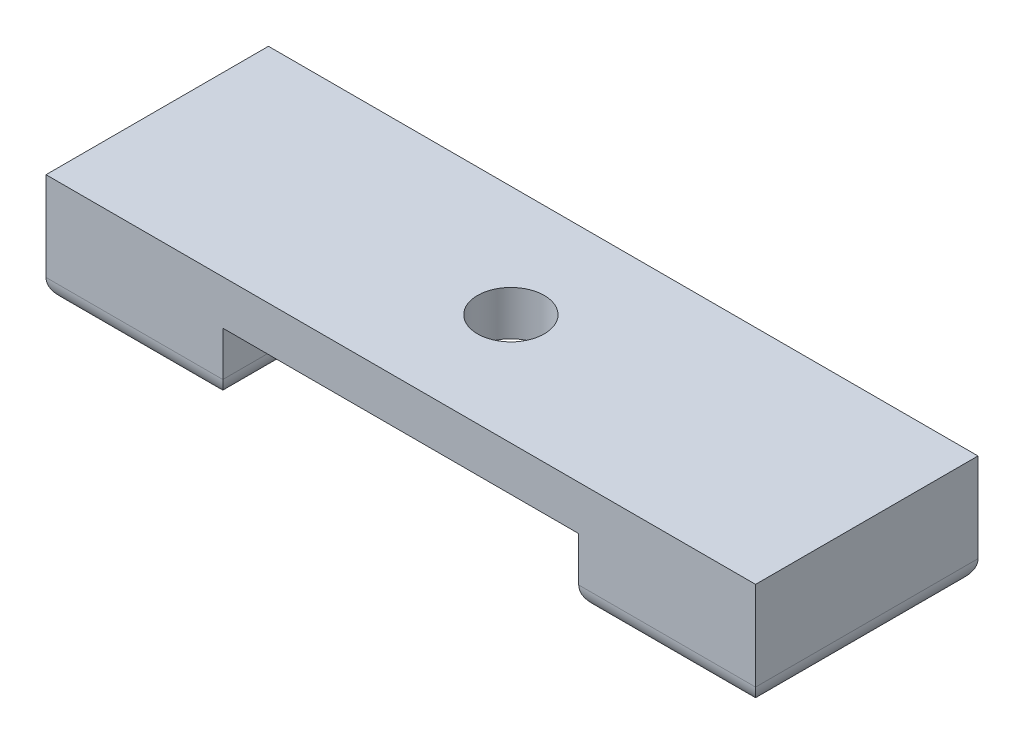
ISO-10303-21;
HEADER;
FILE_DESCRIPTION(('STEP AP214'),'2;1');
FILE_NAME('part.step','',(''),(''),'','','');
FILE_SCHEMA(('AUTOMOTIVE_DESIGN { 1 0 10303 214 1 1 1 1 }'));
ENDSEC;
DATA;
#1=APPLICATION_CONTEXT('core data for automotive mechanical design processes');
#2=APPLICATION_PROTOCOL_DEFINITION('international standard','automotive_design',2000,#1);
#3=PRODUCT_CONTEXT('',#1,'mechanical');
#4=PRODUCT('Part','Part','',(#3));
#5=PRODUCT_RELATED_PRODUCT_CATEGORY('part','',(#4));
#6=PRODUCT_DEFINITION_FORMATION('','',#4);
#7=PRODUCT_DEFINITION_CONTEXT('part definition',#1,'design');
#8=PRODUCT_DEFINITION('design','',#6,#7);
#9=PRODUCT_DEFINITION_SHAPE('','',#8);
#10=(LENGTH_UNIT() NAMED_UNIT(*) SI_UNIT(.MILLI.,.METRE.));
#11=(NAMED_UNIT(*) PLANE_ANGLE_UNIT() SI_UNIT($,.RADIAN.));
#12=(NAMED_UNIT(*) SI_UNIT($,.STERADIAN.) SOLID_ANGLE_UNIT());
#13=UNCERTAINTY_MEASURE_WITH_UNIT(LENGTH_MEASURE(1.E-05),#10,'distance_accuracy_value','');
#14=(GEOMETRIC_REPRESENTATION_CONTEXT(3) GLOBAL_UNCERTAINTY_ASSIGNED_CONTEXT((#13)) GLOBAL_UNIT_ASSIGNED_CONTEXT((#10,
#11,#12)) REPRESENTATION_CONTEXT('',''));
#15=CARTESIAN_POINT('',(0.,0.,0.));
#16=DIRECTION('',(0.,0.,1.));
#17=DIRECTION('',(1.,0.,0.));
#18=AXIS2_PLACEMENT_3D('',#15,#16,#17);
#19=CARTESIAN_POINT('',(0.,5.,10.));
#20=DIRECTION('',(1.,0.,0.));
#21=DIRECTION('',(0.,0.,-1.));
#22=AXIS2_PLACEMENT_3D('',#19,#20,#21);
#23=PLANE('',#22);
#24=DIRECTION('',(0.,-1.,0.));
#25=VECTOR('',#24,1.);
#26=CARTESIAN_POINT('',(0.,5.,0.));
#27=LINE('',#26,#25);
#28=CARTESIAN_POINT('',(0.,5.,0.));
#29=VERTEX_POINT('',#28);
#30=CARTESIAN_POINT('',(0.,1.,0.));
#31=VERTEX_POINT('',#30);
#32=EDGE_CURVE('E151',#29,#31,#27,.T.);
#33=ORIENTED_EDGE('',*,*,#32,.T.);
#34=DIRECTION('',(0.,0.,-1.));
#35=VECTOR('',#34,1.);
#36=CARTESIAN_POINT('',(0.,1.,10.));
#37=LINE('',#36,#35);
#38=CARTESIAN_POINT('',(0.,1.,10.));
#39=VERTEX_POINT('',#38);
#40=EDGE_CURVE('E208',#31,#39,#37,.F.);
#41=ORIENTED_EDGE('',*,*,#40,.T.);
#42=DIRECTION('',(0.,-1.,0.));
#43=VECTOR('',#42,1.);
#44=CARTESIAN_POINT('',(0.,5.,10.));
#45=LINE('',#44,#43);
#46=CARTESIAN_POINT('',(0.,5.,10.));
#47=VERTEX_POINT('',#46);
#48=EDGE_CURVE('E127',#47,#39,#45,.T.);
#49=ORIENTED_EDGE('',*,*,#48,.F.);
#50=DIRECTION('',(0.,0.,-1.));
#51=VECTOR('',#50,1.);
#52=CARTESIAN_POINT('',(0.,5.,10.));
#53=LINE('',#52,#51);
#54=EDGE_CURVE('E150',#47,#29,#53,.T.);
#55=ORIENTED_EDGE('',*,*,#54,.T.);
#56=EDGE_LOOP('',(#33,#41,#49,#55));
#57=FACE_BOUND('',#56,.T.);
#58=ADVANCED_FACE('F33',(#57),#23,.F.);
#59=CARTESIAN_POINT('',(0.,0.,10.));
#60=DIRECTION('',(0.,1.,0.));
#61=DIRECTION('',(0.,0.,1.));
#62=AXIS2_PLACEMENT_3D('',#59,#60,#61);
#63=PLANE('',#62);
#64=DIRECTION('',(1.,0.,0.));
#65=VECTOR('',#64,1.);
#66=CARTESIAN_POINT('',(0.,0.,9.));
#67=LINE('',#66,#65);
#68=CARTESIAN_POINT('',(6.95,0.,9.));
#69=VERTEX_POINT('',#68);
#70=CARTESIAN_POINT('',(1.,0.,9.));
#71=VERTEX_POINT('',#70);
#72=EDGE_CURVE('E203',#69,#71,#67,.F.);
#73=ORIENTED_EDGE('',*,*,#72,.T.);
#74=DIRECTION('',(0.,0.,-1.));
#75=VECTOR('',#74,1.);
#76=CARTESIAN_POINT('',(1.,0.,10.));
#77=LINE('',#76,#75);
#78=CARTESIAN_POINT('',(1.,0.,0.999999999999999));
#79=VERTEX_POINT('',#78);
#80=EDGE_CURVE('E205',#71,#79,#77,.T.);
#81=ORIENTED_EDGE('',*,*,#80,.T.);
#82=DIRECTION('',(1.,0.,0.));
#83=VECTOR('',#82,1.);
#84=CARTESIAN_POINT('',(0.,0.,0.999999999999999));
#85=LINE('',#84,#83);
#86=CARTESIAN_POINT('',(6.95,0.,0.999999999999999));
#87=VERTEX_POINT('',#86);
#88=EDGE_CURVE('E188',#79,#87,#85,.T.);
#89=ORIENTED_EDGE('',*,*,#88,.T.);
#90=DIRECTION('',(0.,0.,-1.));
#91=VECTOR('',#90,1.);
#92=CARTESIAN_POINT('',(6.95,0.,10.));
#93=LINE('',#92,#91);
#94=EDGE_CURVE('E201',#87,#69,#93,.F.);
#95=ORIENTED_EDGE('',*,*,#94,.T.);
#96=EDGE_LOOP('',(#73,#81,#89,#95));
#97=FACE_BOUND('',#96,.T.);
#98=ADVANCED_FACE('F244',(#97),#63,.F.);
#99=CARTESIAN_POINT('',(7.95,0.,10.));
#100=DIRECTION('',(-1.,0.,0.));
#101=DIRECTION('',(0.,0.,1.));
#102=AXIS2_PLACEMENT_3D('',#99,#100,#101);
#103=PLANE('',#102);
#104=DIRECTION('',(0.,1.,0.));
#105=VECTOR('',#104,1.);
#106=CARTESIAN_POINT('',(7.95,0.,10.));
#107=LINE('',#106,#105);
#108=CARTESIAN_POINT('',(7.95,1.,10.));
#109=VERTEX_POINT('',#108);
#110=CARTESIAN_POINT('',(7.95,3.,10.));
#111=VERTEX_POINT('',#110);
#112=EDGE_CURVE('E120',#109,#111,#107,.T.);
#113=ORIENTED_EDGE('',*,*,#112,.F.);
#114=DIRECTION('',(0.,0.,-1.));
#115=VECTOR('',#114,1.);
#116=CARTESIAN_POINT('',(7.95,1.,10.));
#117=LINE('',#116,#115);
#118=CARTESIAN_POINT('',(7.95,1.,0.));
#119=VERTEX_POINT('',#118);
#120=EDGE_CURVE('E42',#109,#119,#117,.T.);
#121=ORIENTED_EDGE('',*,*,#120,.T.);
#122=DIRECTION('',(0.,1.,0.));
#123=VECTOR('',#122,1.);
#124=CARTESIAN_POINT('',(7.95,0.,0.));
#125=LINE('',#124,#123);
#126=CARTESIAN_POINT('',(7.95,3.,0.));
#127=VERTEX_POINT('',#126);
#128=EDGE_CURVE('E132',#119,#127,#125,.T.);
#129=ORIENTED_EDGE('',*,*,#128,.T.);
#130=DIRECTION('',(0.,0.,-1.));
#131=VECTOR('',#130,1.);
#132=CARTESIAN_POINT('',(7.95,3.,10.));
#133=LINE('',#132,#131);
#134=EDGE_CURVE('E130',#111,#127,#133,.T.);
#135=ORIENTED_EDGE('',*,*,#134,.F.);
#136=EDGE_LOOP('',(#113,#121,#129,#135));
#137=FACE_BOUND('',#136,.T.);
#138=ADVANCED_FACE('F131',(#137),#103,.F.);
#139=CARTESIAN_POINT('',(7.95,3.,10.));
#140=DIRECTION('',(0.,1.,0.));
#141=DIRECTION('',(0.,0.,1.));
#142=AXIS2_PLACEMENT_3D('',#139,#140,#141);
#143=PLANE('',#142);
#144=CARTESIAN_POINT('',(15.9,3.,5.));
#145=DIRECTION('',(0.,1.,0.));
#146=DIRECTION('',(0.,0.,1.));
#147=AXIS2_PLACEMENT_3D('',#144,#145,#146);
#148=CIRCLE('',#147,1.5);
#149=CARTESIAN_POINT('',(15.9,3.,6.5));
#150=VERTEX_POINT('',#149);
#151=EDGE_CURVE('E154',#150,#150,#148,.T.);
#152=ORIENTED_EDGE('',*,*,#151,.T.);
#153=EDGE_LOOP('',(#152));
#154=FACE_BOUND('',#153,.T.);
#155=DIRECTION('',(1.,0.,0.));
#156=VECTOR('',#155,1.);
#157=CARTESIAN_POINT('',(7.95,3.,0.));
#158=LINE('',#157,#156);
#159=CARTESIAN_POINT('',(23.95,3.,0.));
#160=VERTEX_POINT('',#159);
#161=EDGE_CURVE('E156',#127,#160,#158,.T.);
#162=ORIENTED_EDGE('',*,*,#161,.T.);
#163=DIRECTION('',(0.,0.,-1.));
#164=VECTOR('',#163,1.);
#165=CARTESIAN_POINT('',(23.95,3.,10.));
#166=LINE('',#165,#164);
#167=CARTESIAN_POINT('',(23.95,3.,10.));
#168=VERTEX_POINT('',#167);
#169=EDGE_CURVE('E136',#168,#160,#166,.T.);
#170=ORIENTED_EDGE('',*,*,#169,.F.);
#171=DIRECTION('',(1.,0.,0.));
#172=VECTOR('',#171,1.);
#173=CARTESIAN_POINT('',(7.95,3.,10.));
#174=LINE('',#173,#172);
#175=EDGE_CURVE('E125',#111,#168,#174,.T.);
#176=ORIENTED_EDGE('',*,*,#175,.F.);
#177=ORIENTED_EDGE('',*,*,#134,.T.);
#178=EDGE_LOOP('',(#162,#170,#176,#177));
#179=FACE_BOUND('',#178,.T.);
#180=ADVANCED_FACE('F138',(#154,#179),#143,.F.);
#181=CARTESIAN_POINT('',(23.95,3.,10.));
#182=DIRECTION('',(1.,0.,0.));
#183=DIRECTION('',(0.,0.,-1.));
#184=AXIS2_PLACEMENT_3D('',#181,#182,#183);
#185=PLANE('',#184);
#186=DIRECTION('',(0.,-1.,0.));
#187=VECTOR('',#186,1.);
#188=CARTESIAN_POINT('',(23.95,3.,0.));
#189=LINE('',#188,#187);
#190=CARTESIAN_POINT('',(23.95,1.,0.));
#191=VERTEX_POINT('',#190);
#192=EDGE_CURVE('E158',#160,#191,#189,.T.);
#193=ORIENTED_EDGE('',*,*,#192,.T.);
#194=DIRECTION('',(0.,0.,-1.));
#195=VECTOR('',#194,1.);
#196=CARTESIAN_POINT('',(23.95,1.,10.));
#197=LINE('',#196,#195);
#198=CARTESIAN_POINT('',(23.95,1.,10.));
#199=VERTEX_POINT('',#198);
#200=EDGE_CURVE('E179',#191,#199,#197,.F.);
#201=ORIENTED_EDGE('',*,*,#200,.T.);
#202=DIRECTION('',(0.,-1.,0.));
#203=VECTOR('',#202,1.);
#204=CARTESIAN_POINT('',(23.95,3.,10.));
#205=LINE('',#204,#203);
#206=EDGE_CURVE('E141',#168,#199,#205,.T.);
#207=ORIENTED_EDGE('',*,*,#206,.F.);
#208=ORIENTED_EDGE('',*,*,#169,.T.);
#209=EDGE_LOOP('',(#193,#201,#207,#208));
#210=FACE_BOUND('',#209,.T.);
#211=ADVANCED_FACE('F343',(#210),#185,.F.);
#212=CARTESIAN_POINT('',(23.95,0.,10.));
#213=DIRECTION('',(0.,1.,0.));
#214=DIRECTION('',(0.,0.,1.));
#215=AXIS2_PLACEMENT_3D('',#212,#213,#214);
#216=PLANE('',#215);
#217=DIRECTION('',(1.,0.,0.));
#218=VECTOR('',#217,1.);
#219=CARTESIAN_POINT('',(23.95,0.,9.));
#220=LINE('',#219,#218);
#221=CARTESIAN_POINT('',(30.9,0.,9.));
#222=VERTEX_POINT('',#221);
#223=CARTESIAN_POINT('',(24.95,0.,9.));
#224=VERTEX_POINT('',#223);
#225=EDGE_CURVE('E174',#222,#224,#220,.F.);
#226=ORIENTED_EDGE('',*,*,#225,.T.);
#227=DIRECTION('',(0.,0.,-1.));
#228=VECTOR('',#227,1.);
#229=CARTESIAN_POINT('',(24.95,0.,10.));
#230=LINE('',#229,#228);
#231=CARTESIAN_POINT('',(24.95,0.,0.999999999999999));
#232=VERTEX_POINT('',#231);
#233=EDGE_CURVE('E176',#224,#232,#230,.T.);
#234=ORIENTED_EDGE('',*,*,#233,.T.);
#235=DIRECTION('',(1.,0.,0.));
#236=VECTOR('',#235,1.);
#237=CARTESIAN_POINT('',(23.95,0.,0.999999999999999));
#238=LINE('',#237,#236);
#239=CARTESIAN_POINT('',(30.9,0.,0.999999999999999));
#240=VERTEX_POINT('',#239);
#241=EDGE_CURVE('E135',#232,#240,#238,.T.);
#242=ORIENTED_EDGE('',*,*,#241,.T.);
#243=DIRECTION('',(0.,0.,-1.));
#244=VECTOR('',#243,1.);
#245=CARTESIAN_POINT('',(30.9,0.,10.));
#246=LINE('',#245,#244);
#247=EDGE_CURVE('E172',#240,#222,#246,.F.);
#248=ORIENTED_EDGE('',*,*,#247,.T.);
#249=EDGE_LOOP('',(#226,#234,#242,#248));
#250=FACE_BOUND('',#249,.T.);
#251=ADVANCED_FACE('F335',(#250),#216,.F.);
#252=CARTESIAN_POINT('',(31.9,0.,10.));
#253=DIRECTION('',(-1.,0.,0.));
#254=DIRECTION('',(0.,0.,1.));
#255=AXIS2_PLACEMENT_3D('',#252,#253,#254);
#256=PLANE('',#255);
#257=DIRECTION('',(0.,1.,0.));
#258=VECTOR('',#257,1.);
#259=CARTESIAN_POINT('',(31.9,0.,10.));
#260=LINE('',#259,#258);
#261=CARTESIAN_POINT('',(31.9,1.,10.));
#262=VERTEX_POINT('',#261);
#263=CARTESIAN_POINT('',(31.9,5.,10.));
#264=VERTEX_POINT('',#263);
#265=EDGE_CURVE('E143',#262,#264,#260,.T.);
#266=ORIENTED_EDGE('',*,*,#265,.F.);
#267=DIRECTION('',(0.,0.,-1.));
#268=VECTOR('',#267,1.);
#269=CARTESIAN_POINT('',(31.9,1.,10.));
#270=LINE('',#269,#268);
#271=CARTESIAN_POINT('',(31.9,1.,0.));
#272=VERTEX_POINT('',#271);
#273=EDGE_CURVE('E184',#262,#272,#270,.T.);
#274=ORIENTED_EDGE('',*,*,#273,.T.);
#275=DIRECTION('',(0.,1.,0.));
#276=VECTOR('',#275,1.);
#277=CARTESIAN_POINT('',(31.9,0.,0.));
#278=LINE('',#277,#276);
#279=CARTESIAN_POINT('',(31.9,5.,0.));
#280=VERTEX_POINT('',#279);
#281=EDGE_CURVE('E161',#272,#280,#278,.T.);
#282=ORIENTED_EDGE('',*,*,#281,.T.);
#283=DIRECTION('',(0.,0.,-1.));
#284=VECTOR('',#283,1.);
#285=CARTESIAN_POINT('',(31.9,5.,10.));
#286=LINE('',#285,#284);
#287=EDGE_CURVE('E167',#264,#280,#286,.T.);
#288=ORIENTED_EDGE('',*,*,#287,.F.);
#289=EDGE_LOOP('',(#266,#274,#282,#288));
#290=FACE_BOUND('',#289,.T.);
#291=ADVANCED_FACE('F327',(#290),#256,.F.);
#292=CARTESIAN_POINT('',(31.9,5.,10.));
#293=DIRECTION('',(0.,-1.,0.));
#294=DIRECTION('',(1.,0.,0.));
#295=AXIS2_PLACEMENT_3D('',#292,#293,#294);
#296=PLANE('',#295);
#297=CARTESIAN_POINT('',(15.9,5.,5.));
#298=DIRECTION('',(0.,1.,0.));
#299=DIRECTION('',(-1.,0.,0.));
#300=AXIS2_PLACEMENT_3D('',#297,#298,#299);
#301=CIRCLE('',#300,1.5);
#302=CARTESIAN_POINT('',(14.4,5.,5.));
#303=VERTEX_POINT('',#302);
#304=EDGE_CURVE('E199',#303,#303,#301,.T.);
#305=ORIENTED_EDGE('',*,*,#304,.F.);
#306=EDGE_LOOP('',(#305));
#307=FACE_BOUND('',#306,.T.);
#308=DIRECTION('',(-1.,0.,0.));
#309=VECTOR('',#308,1.);
#310=CARTESIAN_POINT('',(31.9,5.,0.));
#311=LINE('',#310,#309);
#312=EDGE_CURVE('E163',#280,#29,#311,.T.);
#313=ORIENTED_EDGE('',*,*,#312,.T.);
#314=ORIENTED_EDGE('',*,*,#54,.F.);
#315=DIRECTION('',(-1.,0.,0.));
#316=VECTOR('',#315,1.);
#317=CARTESIAN_POINT('',(31.9,5.,10.));
#318=LINE('',#317,#316);
#319=EDGE_CURVE('E148',#264,#47,#318,.T.);
#320=ORIENTED_EDGE('',*,*,#319,.F.);
#321=ORIENTED_EDGE('',*,*,#287,.T.);
#322=EDGE_LOOP('',(#313,#314,#320,#321));
#323=FACE_BOUND('',#322,.T.);
#324=ADVANCED_FACE('F320',(#307,#323),#296,.F.);
#325=CARTESIAN_POINT('',(0.,0.,10.));
#326=DIRECTION('',(0.,0.,1.));
#327=DIRECTION('',(1.,0.,0.));
#328=AXIS2_PLACEMENT_3D('',#325,#326,#327);
#329=PLANE('',#328);
#330=ORIENTED_EDGE('',*,*,#48,.T.);
#331=DIRECTION('',(1.,0.,0.));
#332=VECTOR('',#331,1.);
#333=CARTESIAN_POINT('',(7.95,1.,10.));
#334=LINE('',#333,#332);
#335=EDGE_CURVE('E57',#39,#109,#334,.T.);
#336=ORIENTED_EDGE('',*,*,#335,.T.);
#337=ORIENTED_EDGE('',*,*,#112,.T.);
#338=ORIENTED_EDGE('',*,*,#175,.T.);
#339=ORIENTED_EDGE('',*,*,#206,.T.);
#340=DIRECTION('',(1.,0.,0.));
#341=VECTOR('',#340,1.);
#342=CARTESIAN_POINT('',(31.9,1.,10.));
#343=LINE('',#342,#341);
#344=EDGE_CURVE('E182',#199,#262,#343,.T.);
#345=ORIENTED_EDGE('',*,*,#344,.T.);
#346=ORIENTED_EDGE('',*,*,#265,.T.);
#347=ORIENTED_EDGE('',*,*,#319,.T.);
#348=EDGE_LOOP('',(#330,#336,#337,#338,#339,#345,#346,#347));
#349=FACE_BOUND('',#348,.T.);
#350=ADVANCED_FACE('F122',(#349),#329,.T.);
#351=CARTESIAN_POINT('',(0.,0.,0.));
#352=DIRECTION('',(0.,0.,1.));
#353=DIRECTION('',(1.,0.,0.));
#354=AXIS2_PLACEMENT_3D('',#351,#352,#353);
#355=PLANE('',#354);
#356=ORIENTED_EDGE('',*,*,#128,.F.);
#357=DIRECTION('',(1.,0.,0.));
#358=VECTOR('',#357,1.);
#359=CARTESIAN_POINT('',(0.,1.,0.));
#360=LINE('',#359,#358);
#361=EDGE_CURVE('E11',#119,#31,#360,.F.);
#362=ORIENTED_EDGE('',*,*,#361,.T.);
#363=ORIENTED_EDGE('',*,*,#32,.F.);
#364=ORIENTED_EDGE('',*,*,#312,.F.);
#365=ORIENTED_EDGE('',*,*,#281,.F.);
#366=DIRECTION('',(1.,0.,0.));
#367=VECTOR('',#366,1.);
#368=CARTESIAN_POINT('',(0.,1.,0.));
#369=LINE('',#368,#367);
#370=EDGE_CURVE('E186',#272,#191,#369,.F.);
#371=ORIENTED_EDGE('',*,*,#370,.T.);
#372=ORIENTED_EDGE('',*,*,#192,.F.);
#373=ORIENTED_EDGE('',*,*,#161,.F.);
#374=EDGE_LOOP('',(#356,#362,#363,#364,#365,#371,#372,#373));
#375=FACE_BOUND('',#374,.T.);
#376=ADVANCED_FACE('F234',(#375),#355,.F.);
#377=CARTESIAN_POINT('',(15.9,-5.,5.));
#378=DIRECTION('',(0.,1.,0.));
#379=DIRECTION('',(-1.,0.,0.));
#380=AXIS2_PLACEMENT_3D('',#377,#378,#379);
#381=CYLINDRICAL_SURFACE('',#380,1.5);
#382=ORIENTED_EDGE('',*,*,#304,.T.);
#383=EDGE_LOOP('',(#382));
#384=FACE_BOUND('',#383,.T.);
#385=ORIENTED_EDGE('',*,*,#151,.F.);
#386=EDGE_LOOP('',(#385));
#387=FACE_BOUND('',#386,.T.);
#388=ADVANCED_FACE('F270',(#384,#387),#381,.F.);
#389=CARTESIAN_POINT('',(30.9,1.,10.));
#390=DIRECTION('',(0.,0.,-1.));
#391=DIRECTION('',(-1.,0.,0.));
#392=AXIS2_PLACEMENT_3D('',#389,#390,#391);
#393=CYLINDRICAL_SURFACE('',#392,1.);
#394=CARTESIAN_POINT('',(30.9,1.,0.999999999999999));
#395=DIRECTION('',(0.707106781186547,0.,0.707106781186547));
#396=DIRECTION('',(0.707106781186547,0.,-0.707106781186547));
#397=AXIS2_PLACEMENT_3D('',#394,#395,#396);
#398=ELLIPSE('',#397,1.41421356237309,1.);
#399=EDGE_CURVE('E193',#272,#240,#398,.F.);
#400=ORIENTED_EDGE('',*,*,#399,.F.);
#401=ORIENTED_EDGE('',*,*,#273,.F.);
#402=CARTESIAN_POINT('',(30.9,1.,9.));
#403=DIRECTION('',(0.707106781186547,0.,-0.707106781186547));
#404=DIRECTION('',(-0.707106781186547,0.,-0.707106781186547));
#405=AXIS2_PLACEMENT_3D('',#402,#403,#404);
#406=ELLIPSE('',#405,1.41421356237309,1.);
#407=EDGE_CURVE('E196',#222,#262,#406,.F.);
#408=ORIENTED_EDGE('',*,*,#407,.F.);
#409=ORIENTED_EDGE('',*,*,#247,.F.);
#410=EDGE_LOOP('',(#400,#401,#408,#409));
#411=FACE_BOUND('',#410,.T.);
#412=ADVANCED_FACE('F266',(#411),#393,.T.);
#413=CARTESIAN_POINT('',(0.,1.,9.));
#414=DIRECTION('',(-1.,0.,0.));
#415=DIRECTION('',(0.,0.,1.));
#416=AXIS2_PLACEMENT_3D('',#413,#414,#415);
#417=CYLINDRICAL_SURFACE('',#416,1.);
#418=ORIENTED_EDGE('',*,*,#407,.T.);
#419=ORIENTED_EDGE('',*,*,#344,.F.);
#420=CARTESIAN_POINT('',(24.95,1.,9.));
#421=DIRECTION('',(-0.707106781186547,0.,-0.707106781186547));
#422=DIRECTION('',(-0.707106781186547,0.,0.707106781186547));
#423=AXIS2_PLACEMENT_3D('',#420,#421,#422);
#424=ELLIPSE('',#423,1.41421356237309,1.);
#425=EDGE_CURVE('E191',#224,#199,#424,.T.);
#426=ORIENTED_EDGE('',*,*,#425,.F.);
#427=ORIENTED_EDGE('',*,*,#225,.F.);
#428=EDGE_LOOP('',(#418,#419,#426,#427));
#429=FACE_BOUND('',#428,.T.);
#430=ADVANCED_FACE('F262',(#429),#417,.T.);
#431=CARTESIAN_POINT('',(23.95,1.,0.999999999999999));
#432=DIRECTION('',(1.,0.,0.));
#433=DIRECTION('',(0.,0.,-1.));
#434=AXIS2_PLACEMENT_3D('',#431,#432,#433);
#435=CYLINDRICAL_SURFACE('',#434,1.);
#436=ORIENTED_EDGE('',*,*,#399,.T.);
#437=ORIENTED_EDGE('',*,*,#241,.F.);
#438=CARTESIAN_POINT('',(24.95,1.,0.999999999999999));
#439=DIRECTION('',(0.707106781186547,0.,-0.707106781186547));
#440=DIRECTION('',(0.707106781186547,0.,0.707106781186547));
#441=AXIS2_PLACEMENT_3D('',#438,#439,#440);
#442=ELLIPSE('',#441,1.41421356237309,1.);
#443=EDGE_CURVE('E189',#191,#232,#442,.F.);
#444=ORIENTED_EDGE('',*,*,#443,.F.);
#445=ORIENTED_EDGE('',*,*,#370,.F.);
#446=EDGE_LOOP('',(#436,#437,#444,#445));
#447=FACE_BOUND('',#446,.T.);
#448=ADVANCED_FACE('F258',(#447),#435,.T.);
#449=CARTESIAN_POINT('',(24.95,1.,10.));
#450=DIRECTION('',(0.,0.,-1.));
#451=DIRECTION('',(-1.,0.,0.));
#452=AXIS2_PLACEMENT_3D('',#449,#450,#451);
#453=CYLINDRICAL_SURFACE('',#452,1.);
#454=ORIENTED_EDGE('',*,*,#425,.T.);
#455=ORIENTED_EDGE('',*,*,#200,.F.);
#456=ORIENTED_EDGE('',*,*,#443,.T.);
#457=ORIENTED_EDGE('',*,*,#233,.F.);
#458=EDGE_LOOP('',(#454,#455,#456,#457));
#459=FACE_BOUND('',#458,.T.);
#460=ADVANCED_FACE('F255',(#459),#453,.T.);
#461=CARTESIAN_POINT('',(6.95,1.,10.));
#462=DIRECTION('',(0.,0.,-1.));
#463=DIRECTION('',(-1.,0.,0.));
#464=AXIS2_PLACEMENT_3D('',#461,#462,#463);
#465=CYLINDRICAL_SURFACE('',#464,1.);
#466=CARTESIAN_POINT('',(6.95,1.,0.999999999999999));
#467=DIRECTION('',(0.707106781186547,0.,0.707106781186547));
#468=DIRECTION('',(0.707106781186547,0.,-0.707106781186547));
#469=AXIS2_PLACEMENT_3D('',#466,#467,#468);
#470=ELLIPSE('',#469,1.41421356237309,1.);
#471=EDGE_CURVE('E216',#119,#87,#470,.F.);
#472=ORIENTED_EDGE('',*,*,#471,.F.);
#473=ORIENTED_EDGE('',*,*,#120,.F.);
#474=CARTESIAN_POINT('',(6.95,1.,9.));
#475=DIRECTION('',(0.707106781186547,0.,-0.707106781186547));
#476=DIRECTION('',(-0.707106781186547,0.,-0.707106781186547));
#477=AXIS2_PLACEMENT_3D('',#474,#475,#476);
#478=ELLIPSE('',#477,1.41421356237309,1.);
#479=EDGE_CURVE('E37',#69,#109,#478,.F.);
#480=ORIENTED_EDGE('',*,*,#479,.F.);
#481=ORIENTED_EDGE('',*,*,#94,.F.);
#482=EDGE_LOOP('',(#472,#473,#480,#481));
#483=FACE_BOUND('',#482,.T.);
#484=ADVANCED_FACE('F35',(#483),#465,.T.);
#485=CARTESIAN_POINT('',(0.,1.,9.));
#486=DIRECTION('',(-1.,0.,0.));
#487=DIRECTION('',(0.,0.,1.));
#488=AXIS2_PLACEMENT_3D('',#485,#486,#487);
#489=CYLINDRICAL_SURFACE('',#488,1.);
#490=ORIENTED_EDGE('',*,*,#479,.T.);
#491=ORIENTED_EDGE('',*,*,#335,.F.);
#492=CARTESIAN_POINT('',(1.,1.,9.));
#493=DIRECTION('',(-0.707106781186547,0.,-0.707106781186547));
#494=DIRECTION('',(-0.707106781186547,0.,0.707106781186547));
#495=AXIS2_PLACEMENT_3D('',#492,#493,#494);
#496=ELLIPSE('',#495,1.41421356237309,1.);
#497=EDGE_CURVE('E215',#71,#39,#496,.T.);
#498=ORIENTED_EDGE('',*,*,#497,.F.);
#499=ORIENTED_EDGE('',*,*,#72,.F.);
#500=EDGE_LOOP('',(#490,#491,#498,#499));
#501=FACE_BOUND('',#500,.T.);
#502=ADVANCED_FACE('F226',(#501),#489,.T.);
#503=CARTESIAN_POINT('',(0.,1.,0.999999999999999));
#504=DIRECTION('',(1.,0.,0.));
#505=DIRECTION('',(0.,0.,-1.));
#506=AXIS2_PLACEMENT_3D('',#503,#504,#505);
#507=CYLINDRICAL_SURFACE('',#506,1.);
#508=ORIENTED_EDGE('',*,*,#471,.T.);
#509=ORIENTED_EDGE('',*,*,#88,.F.);
#510=CARTESIAN_POINT('',(1.,1.,0.999999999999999));
#511=DIRECTION('',(0.707106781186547,0.,-0.707106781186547));
#512=DIRECTION('',(0.707106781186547,0.,0.707106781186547));
#513=AXIS2_PLACEMENT_3D('',#510,#511,#512);
#514=ELLIPSE('',#513,1.41421356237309,1.);
#515=EDGE_CURVE('E213',#31,#79,#514,.F.);
#516=ORIENTED_EDGE('',*,*,#515,.F.);
#517=ORIENTED_EDGE('',*,*,#361,.F.);
#518=EDGE_LOOP('',(#508,#509,#516,#517));
#519=FACE_BOUND('',#518,.T.);
#520=ADVANCED_FACE('F231',(#519),#507,.T.);
#521=CARTESIAN_POINT('',(1.,1.,10.));
#522=DIRECTION('',(0.,0.,-1.));
#523=DIRECTION('',(-1.,0.,0.));
#524=AXIS2_PLACEMENT_3D('',#521,#522,#523);
#525=CYLINDRICAL_SURFACE('',#524,1.);
#526=ORIENTED_EDGE('',*,*,#497,.T.);
#527=ORIENTED_EDGE('',*,*,#40,.F.);
#528=ORIENTED_EDGE('',*,*,#515,.T.);
#529=ORIENTED_EDGE('',*,*,#80,.F.);
#530=EDGE_LOOP('',(#526,#527,#528,#529));
#531=FACE_BOUND('',#530,.T.);
#532=ADVANCED_FACE('F241',(#531),#525,.T.);
#533=CLOSED_SHELL('',(#58,#98,#138,#180,#211,#251,#291,#324,#350,#376,#388,#412,#430,#448,#460,
#484,#502,#520,#532));
#534=MANIFOLD_SOLID_BREP('B2',#533);
#535=ADVANCED_BREP_SHAPE_REPRESENTATION('',(#18,#534),#14);
#536=SHAPE_DEFINITION_REPRESENTATION(#9,#535);
ENDSEC;
END-ISO-10303-21;
